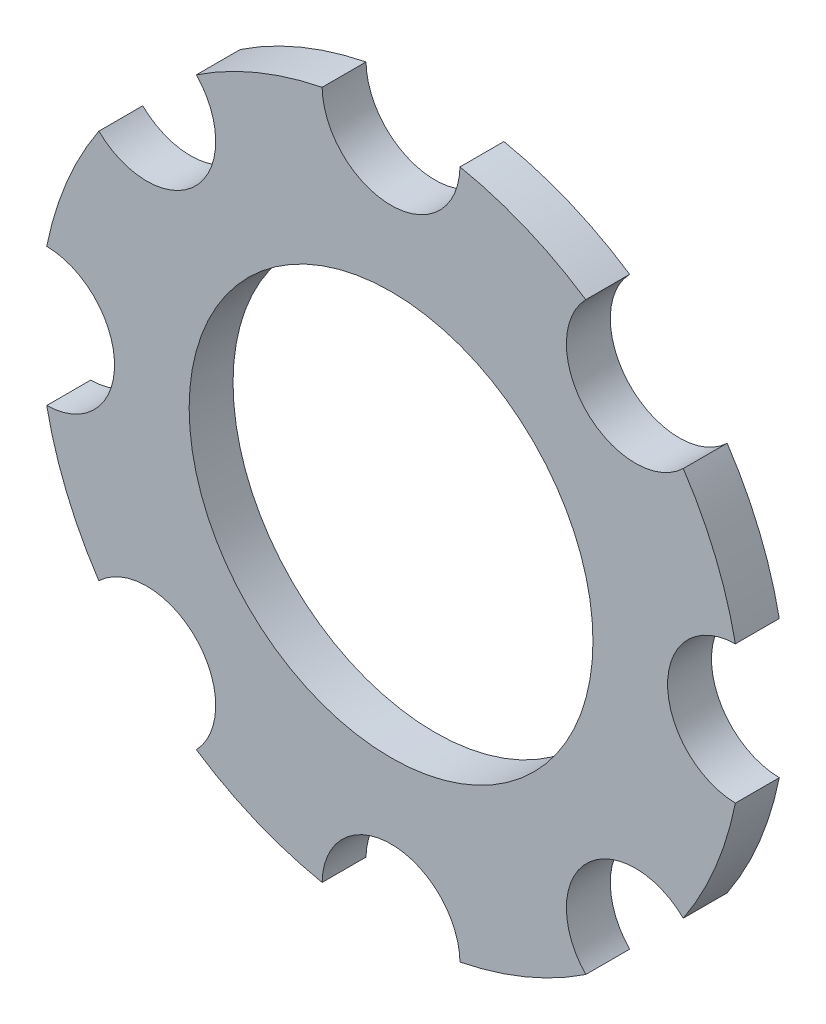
ISO-10303-21;
HEADER;
FILE_DESCRIPTION(('STEP AP214'),'2;1');
FILE_NAME('part.step','',(''),(''),'','','');
FILE_SCHEMA(('AUTOMOTIVE_DESIGN { 1 0 10303 214 1 1 1 1 }'));
ENDSEC;
DATA;
#1=APPLICATION_CONTEXT('core data for automotive mechanical design processes');
#2=APPLICATION_PROTOCOL_DEFINITION('international standard','automotive_design',2000,#1);
#3=PRODUCT_CONTEXT('',#1,'mechanical');
#4=PRODUCT('Part','Part','',(#3));
#5=PRODUCT_RELATED_PRODUCT_CATEGORY('part','',(#4));
#6=PRODUCT_DEFINITION_FORMATION('','',#4);
#7=PRODUCT_DEFINITION_CONTEXT('part definition',#1,'design');
#8=PRODUCT_DEFINITION('design','',#6,#7);
#9=PRODUCT_DEFINITION_SHAPE('','',#8);
#10=(LENGTH_UNIT() NAMED_UNIT(*) SI_UNIT(.MILLI.,.METRE.));
#11=(NAMED_UNIT(*) PLANE_ANGLE_UNIT() SI_UNIT($,.RADIAN.));
#12=(NAMED_UNIT(*) SI_UNIT($,.STERADIAN.) SOLID_ANGLE_UNIT());
#13=UNCERTAINTY_MEASURE_WITH_UNIT(LENGTH_MEASURE(1.E-05),#10,'distance_accuracy_value','');
#14=(GEOMETRIC_REPRESENTATION_CONTEXT(3) GLOBAL_UNCERTAINTY_ASSIGNED_CONTEXT((#13)) GLOBAL_UNIT_ASSIGNED_CONTEXT((#10,
#11,#12)) REPRESENTATION_CONTEXT('',''));
#15=CARTESIAN_POINT('',(0.,0.,0.));
#16=DIRECTION('',(0.,0.,1.));
#17=DIRECTION('',(1.,0.,0.));
#18=AXIS2_PLACEMENT_3D('',#15,#16,#17);
#19=CARTESIAN_POINT('',(0.,0.,-0.5));
#20=DIRECTION('',(0.,0.,1.));
#21=DIRECTION('',(1.,0.,0.));
#22=AXIS2_PLACEMENT_3D('',#19,#20,#21);
#23=CYLINDRICAL_SURFACE('',#22,4.);
#24=DIRECTION('',(0.,0.,1.));
#25=VECTOR('',#24,1.);
#26=CARTESIAN_POINT('',(2.2181037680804,3.32866574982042,-0.25));
#27=LINE('',#26,#25);
#28=CARTESIAN_POINT('',(2.2181037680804,3.32866574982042,-0.5));
#29=VERTEX_POINT('',#28);
#30=CARTESIAN_POINT('',(2.2181037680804,3.32866574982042,0.));
#31=VERTEX_POINT('',#30);
#32=EDGE_CURVE('E53',#29,#31,#27,.T.);
#33=ORIENTED_EDGE('',*,*,#32,.F.);
#34=CARTESIAN_POINT('',(0.,0.,-0.5));
#35=DIRECTION('',(0.,0.,1.));
#36=DIRECTION('',(1.,0.,0.));
#37=AXIS2_PLACEMENT_3D('',#34,#35,#36);
#38=CIRCLE('',#37,4.);
#39=CARTESIAN_POINT('',(0.785285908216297,3.92215833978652,-0.5));
#40=VERTEX_POINT('',#39);
#41=EDGE_CURVE('E176',#29,#40,#38,.T.);
#42=ORIENTED_EDGE('',*,*,#41,.T.);
#43=DIRECTION('',(0.,0.,1.));
#44=VECTOR('',#43,1.);
#45=CARTESIAN_POINT('',(0.785285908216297,3.92215833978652,-0.25));
#46=LINE('',#45,#44);
#47=CARTESIAN_POINT('',(0.785285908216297,3.92215833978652,0.));
#48=VERTEX_POINT('',#47);
#49=EDGE_CURVE('E258',#48,#40,#46,.F.);
#50=ORIENTED_EDGE('',*,*,#49,.F.);
#51=CARTESIAN_POINT('',(0.,0.,0.));
#52=DIRECTION('',(0.,0.,1.));
#53=DIRECTION('',(1.,0.,0.));
#54=AXIS2_PLACEMENT_3D('',#51,#52,#53);
#55=CIRCLE('',#54,4.);
#56=EDGE_CURVE('E168',#31,#48,#55,.T.);
#57=ORIENTED_EDGE('',*,*,#56,.F.);
#58=EDGE_LOOP('',(#33,#42,#50,#57));
#59=FACE_BOUND('',#58,.T.);
#60=ADVANCED_FACE('F39',(#59),#23,.T.);
#61=DIRECTION('',(0.,0.,1.));
#62=VECTOR('',#61,1.);
#63=CARTESIAN_POINT('',(3.32866574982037,2.21810376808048,-0.25));
#64=LINE('',#63,#62);
#65=CARTESIAN_POINT('',(3.32866574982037,2.21810376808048,0.));
#66=VERTEX_POINT('',#65);
#67=CARTESIAN_POINT('',(3.32866574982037,2.21810376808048,-0.5));
#68=VERTEX_POINT('',#67);
#69=EDGE_CURVE('E150',#66,#68,#64,.F.);
#70=ORIENTED_EDGE('',*,*,#69,.F.);
#71=CARTESIAN_POINT('',(3.92215833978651,0.785285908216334,0.));
#72=VERTEX_POINT('',#71);
#73=EDGE_CURVE('E159',#72,#66,#55,.T.);
#74=ORIENTED_EDGE('',*,*,#73,.F.);
#75=DIRECTION('',(0.,0.,1.));
#76=VECTOR('',#75,1.);
#77=CARTESIAN_POINT('',(3.92215833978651,0.785285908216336,-0.25));
#78=LINE('',#77,#76);
#79=CARTESIAN_POINT('',(3.92215833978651,0.785285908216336,-0.5));
#80=VERTEX_POINT('',#79);
#81=EDGE_CURVE('E61',#80,#72,#78,.T.);
#82=ORIENTED_EDGE('',*,*,#81,.F.);
#83=EDGE_CURVE('E161',#80,#68,#38,.T.);
#84=ORIENTED_EDGE('',*,*,#83,.T.);
#85=EDGE_LOOP('',(#70,#74,#82,#84));
#86=FACE_BOUND('',#85,.T.);
#87=ADVANCED_FACE('F158',(#86),#23,.T.);
#88=DIRECTION('',(0.,0.,1.));
#89=VECTOR('',#88,1.);
#90=CARTESIAN_POINT('',(3.92215833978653,-0.785285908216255,-0.25));
#91=LINE('',#90,#89);
#92=CARTESIAN_POINT('',(3.92215833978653,-0.785285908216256,0.));
#93=VERTEX_POINT('',#92);
#94=CARTESIAN_POINT('',(3.92215833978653,-0.785285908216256,-0.5));
#95=VERTEX_POINT('',#94);
#96=EDGE_CURVE('E194',#93,#95,#91,.F.);
#97=ORIENTED_EDGE('',*,*,#96,.F.);
#98=CARTESIAN_POINT('',(3.32866574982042,-2.21810376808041,0.));
#99=VERTEX_POINT('',#98);
#100=EDGE_CURVE('E167',#99,#93,#55,.T.);
#101=ORIENTED_EDGE('',*,*,#100,.F.);
#102=DIRECTION('',(0.,0.,1.));
#103=VECTOR('',#102,1.);
#104=CARTESIAN_POINT('',(3.32866574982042,-2.21810376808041,-0.25));
#105=LINE('',#104,#103);
#106=CARTESIAN_POINT('',(3.32866574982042,-2.21810376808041,-0.5));
#107=VERTEX_POINT('',#106);
#108=EDGE_CURVE('E214',#107,#99,#105,.T.);
#109=ORIENTED_EDGE('',*,*,#108,.F.);
#110=EDGE_CURVE('E202',#107,#95,#38,.T.);
#111=ORIENTED_EDGE('',*,*,#110,.T.);
#112=EDGE_LOOP('',(#97,#101,#109,#111));
#113=FACE_BOUND('',#112,.T.);
#114=ADVANCED_FACE('F199',(#113),#23,.T.);
#115=DIRECTION('',(0.,0.,1.));
#116=VECTOR('',#115,1.);
#117=CARTESIAN_POINT('',(2.21810376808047,-3.32866574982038,-0.25));
#118=LINE('',#117,#116);
#119=CARTESIAN_POINT('',(2.21810376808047,-3.32866574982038,0.));
#120=VERTEX_POINT('',#119);
#121=CARTESIAN_POINT('',(2.21810376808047,-3.32866574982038,-0.5));
#122=VERTEX_POINT('',#121);
#123=EDGE_CURVE('E212',#120,#122,#118,.F.);
#124=ORIENTED_EDGE('',*,*,#123,.F.);
#125=CARTESIAN_POINT('',(0.785285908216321,-3.92215833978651,0.));
#126=VERTEX_POINT('',#125);
#127=EDGE_CURVE('E170',#126,#120,#55,.T.);
#128=ORIENTED_EDGE('',*,*,#127,.F.);
#129=DIRECTION('',(0.,0.,1.));
#130=VECTOR('',#129,1.);
#131=CARTESIAN_POINT('',(0.785285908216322,-3.92215833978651,-0.25));
#132=LINE('',#131,#130);
#133=CARTESIAN_POINT('',(0.785285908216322,-3.92215833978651,-0.5));
#134=VERTEX_POINT('',#133);
#135=EDGE_CURVE('E232',#134,#126,#132,.T.);
#136=ORIENTED_EDGE('',*,*,#135,.F.);
#137=EDGE_CURVE('E220',#134,#122,#38,.T.);
#138=ORIENTED_EDGE('',*,*,#137,.T.);
#139=EDGE_LOOP('',(#124,#128,#136,#138));
#140=FACE_BOUND('',#139,.T.);
#141=ADVANCED_FACE('F217',(#140),#23,.T.);
#142=DIRECTION('',(0.,0.,1.));
#143=VECTOR('',#142,1.);
#144=CARTESIAN_POINT('',(-0.785285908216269,-3.92215833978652,-0.25));
#145=LINE('',#144,#143);
#146=CARTESIAN_POINT('',(-0.785285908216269,-3.92215833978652,0.));
#147=VERTEX_POINT('',#146);
#148=CARTESIAN_POINT('',(-0.785285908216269,-3.92215833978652,-0.5));
#149=VERTEX_POINT('',#148);
#150=EDGE_CURVE('E230',#147,#149,#145,.F.);
#151=ORIENTED_EDGE('',*,*,#150,.F.);
#152=CARTESIAN_POINT('',(-2.21810376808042,-3.32866574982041,0.));
#153=VERTEX_POINT('',#152);
#154=EDGE_CURVE('E332',#153,#147,#55,.T.);
#155=ORIENTED_EDGE('',*,*,#154,.F.);
#156=DIRECTION('',(0.,0.,1.));
#157=VECTOR('',#156,1.);
#158=CARTESIAN_POINT('',(-2.21810376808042,-3.32866574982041,-0.25));
#159=LINE('',#158,#157);
#160=CARTESIAN_POINT('',(-2.21810376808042,-3.32866574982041,-0.5));
#161=VERTEX_POINT('',#160);
#162=EDGE_CURVE('E239',#161,#153,#159,.T.);
#163=ORIENTED_EDGE('',*,*,#162,.F.);
#164=EDGE_CURVE('E316',#161,#149,#38,.T.);
#165=ORIENTED_EDGE('',*,*,#164,.T.);
#166=EDGE_LOOP('',(#151,#155,#163,#165));
#167=FACE_BOUND('',#166,.T.);
#168=ADVANCED_FACE('F326',(#167),#23,.T.);
#169=DIRECTION('',(0.,0.,1.));
#170=VECTOR('',#169,1.);
#171=CARTESIAN_POINT('',(-3.32866574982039,-2.21810376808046,-0.25));
#172=LINE('',#171,#170);
#173=CARTESIAN_POINT('',(-3.32866574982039,-2.21810376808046,0.));
#174=VERTEX_POINT('',#173);
#175=CARTESIAN_POINT('',(-3.32866574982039,-2.21810376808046,-0.5));
#176=VERTEX_POINT('',#175);
#177=EDGE_CURVE('E237',#174,#176,#172,.F.);
#178=ORIENTED_EDGE('',*,*,#177,.F.);
#179=CARTESIAN_POINT('',(-3.92215833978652,-0.785285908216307,0.));
#180=VERTEX_POINT('',#179);
#181=EDGE_CURVE('E334',#180,#174,#55,.T.);
#182=ORIENTED_EDGE('',*,*,#181,.F.);
#183=DIRECTION('',(0.,0.,1.));
#184=VECTOR('',#183,1.);
#185=CARTESIAN_POINT('',(-3.92215833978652,-0.785285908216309,-0.25));
#186=LINE('',#185,#184);
#187=CARTESIAN_POINT('',(-3.92215833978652,-0.785285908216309,-0.5));
#188=VERTEX_POINT('',#187);
#189=EDGE_CURVE('E246',#188,#180,#186,.T.);
#190=ORIENTED_EDGE('',*,*,#189,.F.);
#191=EDGE_CURVE('E311',#188,#176,#38,.T.);
#192=ORIENTED_EDGE('',*,*,#191,.T.);
#193=EDGE_LOOP('',(#178,#182,#190,#192));
#194=FACE_BOUND('',#193,.T.);
#195=ADVANCED_FACE('F293',(#194),#23,.T.);
#196=DIRECTION('',(0.,0.,1.));
#197=VECTOR('',#196,1.);
#198=CARTESIAN_POINT('',(-3.92215833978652,0.785285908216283,-0.25));
#199=LINE('',#198,#197);
#200=CARTESIAN_POINT('',(-3.92215833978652,0.785285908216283,0.));
#201=VERTEX_POINT('',#200);
#202=CARTESIAN_POINT('',(-3.92215833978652,0.785285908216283,-0.5));
#203=VERTEX_POINT('',#202);
#204=EDGE_CURVE('E244',#201,#203,#199,.F.);
#205=ORIENTED_EDGE('',*,*,#204,.F.);
#206=CARTESIAN_POINT('',(-3.3286657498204,2.21810376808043,0.));
#207=VERTEX_POINT('',#206);
#208=EDGE_CURVE('E177',#207,#201,#55,.T.);
#209=ORIENTED_EDGE('',*,*,#208,.F.);
#210=DIRECTION('',(0.,0.,1.));
#211=VECTOR('',#210,1.);
#212=CARTESIAN_POINT('',(-3.3286657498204,2.21810376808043,-0.25));
#213=LINE('',#212,#211);
#214=CARTESIAN_POINT('',(-3.3286657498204,2.21810376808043,-0.5));
#215=VERTEX_POINT('',#214);
#216=EDGE_CURVE('E253',#215,#207,#213,.T.);
#217=ORIENTED_EDGE('',*,*,#216,.F.);
#218=EDGE_CURVE('E309',#215,#203,#38,.T.);
#219=ORIENTED_EDGE('',*,*,#218,.T.);
#220=EDGE_LOOP('',(#205,#209,#217,#219));
#221=FACE_BOUND('',#220,.T.);
#222=ADVANCED_FACE('F288',(#221),#23,.T.);
#223=DIRECTION('',(0.,0.,1.));
#224=VECTOR('',#223,1.);
#225=CARTESIAN_POINT('',(-2.21810376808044,3.32866574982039,-0.25));
#226=LINE('',#225,#224);
#227=CARTESIAN_POINT('',(-2.21810376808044,3.32866574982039,0.));
#228=VERTEX_POINT('',#227);
#229=CARTESIAN_POINT('',(-2.21810376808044,3.32866574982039,-0.5));
#230=VERTEX_POINT('',#229);
#231=EDGE_CURVE('E251',#228,#230,#226,.F.);
#232=ORIENTED_EDGE('',*,*,#231,.F.);
#233=CARTESIAN_POINT('',(-0.785285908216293,3.92215833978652,0.));
#234=VERTEX_POINT('',#233);
#235=EDGE_CURVE('E172',#234,#228,#55,.T.);
#236=ORIENTED_EDGE('',*,*,#235,.F.);
#237=DIRECTION('',(0.,0.,1.));
#238=VECTOR('',#237,1.);
#239=CARTESIAN_POINT('',(-0.785285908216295,3.92215833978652,-0.25));
#240=LINE('',#239,#238);
#241=CARTESIAN_POINT('',(-0.785285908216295,3.92215833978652,-0.5));
#242=VERTEX_POINT('',#241);
#243=EDGE_CURVE('E261',#242,#234,#240,.T.);
#244=ORIENTED_EDGE('',*,*,#243,.F.);
#245=EDGE_CURVE('E178',#242,#230,#38,.T.);
#246=ORIENTED_EDGE('',*,*,#245,.T.);
#247=EDGE_LOOP('',(#232,#236,#244,#246));
#248=FACE_BOUND('',#247,.T.);
#249=ADVANCED_FACE('F41',(#248),#23,.T.);
#250=CARTESIAN_POINT('',(0.,0.,-0.5));
#251=DIRECTION('',(0.,0.,1.));
#252=DIRECTION('',(1.,0.,0.));
#253=AXIS2_PLACEMENT_3D('',#250,#251,#252);
#254=PLANE('',#253);
#255=CARTESIAN_POINT('',(0.,0.,-0.5));
#256=DIRECTION('',(0.,0.,1.));
#257=DIRECTION('',(1.,0.,0.));
#258=AXIS2_PLACEMENT_3D('',#255,#256,#257);
#259=CIRCLE('',#258,2.3);
#260=CARTESIAN_POINT('',(2.3,0.,-0.5));
#261=VERTEX_POINT('',#260);
#262=EDGE_CURVE('E171',#261,#261,#259,.T.);
#263=ORIENTED_EDGE('',*,*,#262,.T.);
#264=EDGE_LOOP('',(#263));
#265=FACE_BOUND('',#264,.T.);
#266=ORIENTED_EDGE('',*,*,#41,.F.);
#267=CARTESIAN_POINT('',(2.78274625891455,2.78274625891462,-0.5));
#268=DIRECTION('',(0.,0.,1.));
#269=DIRECTION('',(-0.707106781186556,0.707106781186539,0.));
#270=AXIS2_PLACEMENT_3D('',#267,#268,#269);
#271=CIRCLE('',#270,0.7853975);
#272=EDGE_CURVE('E162',#29,#68,#271,.T.);
#273=ORIENTED_EDGE('',*,*,#272,.T.);
#274=ORIENTED_EDGE('',*,*,#83,.F.);
#275=CARTESIAN_POINT('',(3.9353975,0.,-0.5));
#276=DIRECTION('',(0.,0.,1.));
#277=DIRECTION('',(0.,1.,0.));
#278=AXIS2_PLACEMENT_3D('',#275,#276,#277);
#279=CIRCLE('',#278,0.7853975);
#280=EDGE_CURVE('E203',#80,#95,#279,.T.);
#281=ORIENTED_EDGE('',*,*,#280,.T.);
#282=ORIENTED_EDGE('',*,*,#110,.F.);
#283=CARTESIAN_POINT('',(2.78274625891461,-2.78274625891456,-0.5));
#284=DIRECTION('',(0.,0.,1.));
#285=DIRECTION('',(0.707106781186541,0.707106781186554,0.));
#286=AXIS2_PLACEMENT_3D('',#283,#284,#285);
#287=CIRCLE('',#286,0.7853975);
#288=EDGE_CURVE('E221',#107,#122,#287,.T.);
#289=ORIENTED_EDGE('',*,*,#288,.T.);
#290=ORIENTED_EDGE('',*,*,#137,.F.);
#291=CARTESIAN_POINT('',(0.,-3.9353975,-0.5));
#292=DIRECTION('',(0.,0.,1.));
#293=DIRECTION('',(1.,0.,0.));
#294=AXIS2_PLACEMENT_3D('',#291,#292,#293);
#295=CIRCLE('',#294,0.7853975);
#296=EDGE_CURVE('E223',#134,#149,#295,.T.);
#297=ORIENTED_EDGE('',*,*,#296,.T.);
#298=ORIENTED_EDGE('',*,*,#164,.F.);
#299=CARTESIAN_POINT('',(-2.78274625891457,-2.7827462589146,-0.5));
#300=DIRECTION('',(0.,0.,1.));
#301=DIRECTION('',(0.707106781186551,-0.707106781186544,0.));
#302=AXIS2_PLACEMENT_3D('',#299,#300,#301);
#303=CIRCLE('',#302,0.7853975);
#304=EDGE_CURVE('E234',#161,#176,#303,.T.);
#305=ORIENTED_EDGE('',*,*,#304,.T.);
#306=ORIENTED_EDGE('',*,*,#191,.F.);
#307=CARTESIAN_POINT('',(-3.9353975,0.,-0.5));
#308=DIRECTION('',(0.,0.,1.));
#309=DIRECTION('',(0.,-1.,0.));
#310=AXIS2_PLACEMENT_3D('',#307,#308,#309);
#311=CIRCLE('',#310,0.7853975);
#312=EDGE_CURVE('E241',#188,#203,#311,.T.);
#313=ORIENTED_EDGE('',*,*,#312,.T.);
#314=ORIENTED_EDGE('',*,*,#218,.F.);
#315=CARTESIAN_POINT('',(-2.78274625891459,2.78274625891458,-0.5));
#316=DIRECTION('',(0.,0.,1.));
#317=DIRECTION('',(-0.707106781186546,-0.707106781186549,0.));
#318=AXIS2_PLACEMENT_3D('',#315,#316,#317);
#319=CIRCLE('',#318,0.7853975);
#320=EDGE_CURVE('E248',#215,#230,#319,.T.);
#321=ORIENTED_EDGE('',*,*,#320,.T.);
#322=ORIENTED_EDGE('',*,*,#245,.F.);
#323=CARTESIAN_POINT('',(0.,3.9353975,-0.5));
#324=DIRECTION('',(0.,0.,1.));
#325=DIRECTION('',(-1.,0.,0.));
#326=AXIS2_PLACEMENT_3D('',#323,#324,#325);
#327=CIRCLE('',#326,0.7853975);
#328=EDGE_CURVE('E255',#242,#40,#327,.T.);
#329=ORIENTED_EDGE('',*,*,#328,.T.);
#330=EDGE_LOOP('',(#266,#273,#274,#281,#282,#289,#290,#297,#298,#305,#306,#313,#314,#321,#322,#329));
#331=FACE_BOUND('',#330,.T.);
#332=ADVANCED_FACE('F270',(#265,#331),#254,.F.);
#333=CARTESIAN_POINT('',(0.,0.,0.));
#334=DIRECTION('',(0.,0.,1.));
#335=DIRECTION('',(1.,0.,0.));
#336=AXIS2_PLACEMENT_3D('',#333,#334,#335);
#337=PLANE('',#336);
#338=CARTESIAN_POINT('',(2.78274625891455,2.78274625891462,0.));
#339=DIRECTION('',(0.,0.,1.));
#340=DIRECTION('',(1.,0.,0.));
#341=AXIS2_PLACEMENT_3D('',#338,#339,#340);
#342=CIRCLE('',#341,0.7853975);
#343=EDGE_CURVE('E11',#31,#66,#342,.T.);
#344=ORIENTED_EDGE('',*,*,#343,.F.);
#345=ORIENTED_EDGE('',*,*,#56,.T.);
#346=CARTESIAN_POINT('',(0.,3.9353975,0.));
#347=DIRECTION('',(0.,0.,1.));
#348=DIRECTION('',(1.,0.,0.));
#349=AXIS2_PLACEMENT_3D('',#346,#347,#348);
#350=CIRCLE('',#349,0.7853975);
#351=EDGE_CURVE('E180',#234,#48,#350,.T.);
#352=ORIENTED_EDGE('',*,*,#351,.F.);
#353=ORIENTED_EDGE('',*,*,#235,.T.);
#354=CARTESIAN_POINT('',(-2.78274625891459,2.78274625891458,0.));
#355=DIRECTION('',(0.,0.,1.));
#356=DIRECTION('',(1.,0.,0.));
#357=AXIS2_PLACEMENT_3D('',#354,#355,#356);
#358=CIRCLE('',#357,0.7853975);
#359=EDGE_CURVE('E183',#207,#228,#358,.T.);
#360=ORIENTED_EDGE('',*,*,#359,.F.);
#361=ORIENTED_EDGE('',*,*,#208,.T.);
#362=CARTESIAN_POINT('',(-3.9353975,0.,0.));
#363=DIRECTION('',(0.,0.,1.));
#364=DIRECTION('',(1.,0.,0.));
#365=AXIS2_PLACEMENT_3D('',#362,#363,#364);
#366=CIRCLE('',#365,0.7853975);
#367=EDGE_CURVE('E185',#180,#201,#366,.T.);
#368=ORIENTED_EDGE('',*,*,#367,.F.);
#369=ORIENTED_EDGE('',*,*,#181,.T.);
#370=CARTESIAN_POINT('',(-2.78274625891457,-2.7827462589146,0.));
#371=DIRECTION('',(0.,0.,1.));
#372=DIRECTION('',(1.,0.,0.));
#373=AXIS2_PLACEMENT_3D('',#370,#371,#372);
#374=CIRCLE('',#373,0.7853975);
#375=EDGE_CURVE('E187',#153,#174,#374,.T.);
#376=ORIENTED_EDGE('',*,*,#375,.F.);
#377=ORIENTED_EDGE('',*,*,#154,.T.);
#378=CARTESIAN_POINT('',(0.,-3.9353975,0.));
#379=DIRECTION('',(0.,0.,1.));
#380=DIRECTION('',(1.,0.,0.));
#381=AXIS2_PLACEMENT_3D('',#378,#379,#380);
#382=CIRCLE('',#381,0.7853975);
#383=EDGE_CURVE('E189',#126,#147,#382,.T.);
#384=ORIENTED_EDGE('',*,*,#383,.F.);
#385=ORIENTED_EDGE('',*,*,#127,.T.);
#386=CARTESIAN_POINT('',(2.78274625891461,-2.78274625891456,0.));
#387=DIRECTION('',(0.,0.,1.));
#388=DIRECTION('',(1.,0.,0.));
#389=AXIS2_PLACEMENT_3D('',#386,#387,#388);
#390=CIRCLE('',#389,0.7853975);
#391=EDGE_CURVE('E191',#99,#120,#390,.T.);
#392=ORIENTED_EDGE('',*,*,#391,.F.);
#393=ORIENTED_EDGE('',*,*,#100,.T.);
#394=CARTESIAN_POINT('',(3.9353975,0.,0.));
#395=DIRECTION('',(0.,0.,1.));
#396=DIRECTION('',(1.,0.,0.));
#397=AXIS2_PLACEMENT_3D('',#394,#395,#396);
#398=CIRCLE('',#397,0.7853975);
#399=EDGE_CURVE('E47',#72,#93,#398,.T.);
#400=ORIENTED_EDGE('',*,*,#399,.F.);
#401=ORIENTED_EDGE('',*,*,#73,.T.);
#402=EDGE_LOOP('',(#344,#345,#352,#353,#360,#361,#368,#369,#376,#377,#384,#385,#392,#393,#400,#401));
#403=FACE_BOUND('',#402,.T.);
#404=CARTESIAN_POINT('',(0.,0.,0.));
#405=DIRECTION('',(0.,0.,1.));
#406=DIRECTION('',(1.,0.,0.));
#407=AXIS2_PLACEMENT_3D('',#404,#405,#406);
#408=CIRCLE('',#407,2.3);
#409=CARTESIAN_POINT('',(2.3,0.,0.));
#410=VERTEX_POINT('',#409);
#411=EDGE_CURVE('E263',#410,#410,#408,.T.);
#412=ORIENTED_EDGE('',*,*,#411,.F.);
#413=EDGE_LOOP('',(#412));
#414=FACE_BOUND('',#413,.T.);
#415=ADVANCED_FACE('F164',(#403,#414),#337,.T.);
#416=CARTESIAN_POINT('',(0.,0.,-0.5));
#417=DIRECTION('',(0.,0.,1.));
#418=DIRECTION('',(1.,0.,0.));
#419=AXIS2_PLACEMENT_3D('',#416,#417,#418);
#420=CYLINDRICAL_SURFACE('',#419,2.3);
#421=ORIENTED_EDGE('',*,*,#262,.F.);
#422=EDGE_LOOP('',(#421));
#423=FACE_BOUND('',#422,.T.);
#424=ORIENTED_EDGE('',*,*,#411,.T.);
#425=EDGE_LOOP('',(#424));
#426=FACE_BOUND('',#425,.T.);
#427=ADVANCED_FACE('F268',(#423,#426),#420,.F.);
#428=CARTESIAN_POINT('',(0.,3.9353975,-0.5));
#429=DIRECTION('',(0.,0.,1.));
#430=DIRECTION('',(1.,0.,0.));
#431=AXIS2_PLACEMENT_3D('',#428,#429,#430);
#432=CYLINDRICAL_SURFACE('',#431,0.7853975);
#433=ORIENTED_EDGE('',*,*,#243,.T.);
#434=ORIENTED_EDGE('',*,*,#351,.T.);
#435=ORIENTED_EDGE('',*,*,#49,.T.);
#436=ORIENTED_EDGE('',*,*,#328,.F.);
#437=EDGE_LOOP('',(#433,#434,#435,#436));
#438=FACE_BOUND('',#437,.T.);
#439=ADVANCED_FACE('F276',(#438),#432,.F.);
#440=CARTESIAN_POINT('',(-2.78274625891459,2.78274625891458,-0.5));
#441=DIRECTION('',(0.,0.,1.));
#442=DIRECTION('',(1.,0.,0.));
#443=AXIS2_PLACEMENT_3D('',#440,#441,#442);
#444=CYLINDRICAL_SURFACE('',#443,0.7853975);
#445=ORIENTED_EDGE('',*,*,#216,.T.);
#446=ORIENTED_EDGE('',*,*,#359,.T.);
#447=ORIENTED_EDGE('',*,*,#231,.T.);
#448=ORIENTED_EDGE('',*,*,#320,.F.);
#449=EDGE_LOOP('',(#445,#446,#447,#448));
#450=FACE_BOUND('',#449,.T.);
#451=ADVANCED_FACE('F339',(#450),#444,.F.);
#452=CARTESIAN_POINT('',(-3.9353975,0.,-0.5));
#453=DIRECTION('',(0.,0.,1.));
#454=DIRECTION('',(1.,0.,0.));
#455=AXIS2_PLACEMENT_3D('',#452,#453,#454);
#456=CYLINDRICAL_SURFACE('',#455,0.7853975);
#457=ORIENTED_EDGE('',*,*,#189,.T.);
#458=ORIENTED_EDGE('',*,*,#367,.T.);
#459=ORIENTED_EDGE('',*,*,#204,.T.);
#460=ORIENTED_EDGE('',*,*,#312,.F.);
#461=EDGE_LOOP('',(#457,#458,#459,#460));
#462=FACE_BOUND('',#461,.T.);
#463=ADVANCED_FACE('F338',(#462),#456,.F.);
#464=CARTESIAN_POINT('',(-2.78274625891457,-2.7827462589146,-0.5));
#465=DIRECTION('',(0.,0.,1.));
#466=DIRECTION('',(1.,0.,0.));
#467=AXIS2_PLACEMENT_3D('',#464,#465,#466);
#468=CYLINDRICAL_SURFACE('',#467,0.7853975);
#469=ORIENTED_EDGE('',*,*,#162,.T.);
#470=ORIENTED_EDGE('',*,*,#375,.T.);
#471=ORIENTED_EDGE('',*,*,#177,.T.);
#472=ORIENTED_EDGE('',*,*,#304,.F.);
#473=EDGE_LOOP('',(#469,#470,#471,#472));
#474=FACE_BOUND('',#473,.T.);
#475=ADVANCED_FACE('F344',(#474),#468,.F.);
#476=CARTESIAN_POINT('',(0.,-3.9353975,-0.5));
#477=DIRECTION('',(0.,0.,1.));
#478=DIRECTION('',(1.,0.,0.));
#479=AXIS2_PLACEMENT_3D('',#476,#477,#478);
#480=CYLINDRICAL_SURFACE('',#479,0.7853975);
#481=ORIENTED_EDGE('',*,*,#135,.T.);
#482=ORIENTED_EDGE('',*,*,#383,.T.);
#483=ORIENTED_EDGE('',*,*,#150,.T.);
#484=ORIENTED_EDGE('',*,*,#296,.F.);
#485=EDGE_LOOP('',(#481,#482,#483,#484));
#486=FACE_BOUND('',#485,.T.);
#487=ADVANCED_FACE('F330',(#486),#480,.F.);
#488=CARTESIAN_POINT('',(2.78274625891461,-2.78274625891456,-0.5));
#489=DIRECTION('',(0.,0.,1.));
#490=DIRECTION('',(1.,0.,0.));
#491=AXIS2_PLACEMENT_3D('',#488,#489,#490);
#492=CYLINDRICAL_SURFACE('',#491,0.7853975);
#493=ORIENTED_EDGE('',*,*,#108,.T.);
#494=ORIENTED_EDGE('',*,*,#391,.T.);
#495=ORIENTED_EDGE('',*,*,#123,.T.);
#496=ORIENTED_EDGE('',*,*,#288,.F.);
#497=EDGE_LOOP('',(#493,#494,#495,#496));
#498=FACE_BOUND('',#497,.T.);
#499=ADVANCED_FACE('F211',(#498),#492,.F.);
#500=CARTESIAN_POINT('',(3.9353975,0.,-0.5));
#501=DIRECTION('',(0.,0.,1.));
#502=DIRECTION('',(1.,0.,0.));
#503=AXIS2_PLACEMENT_3D('',#500,#501,#502);
#504=CYLINDRICAL_SURFACE('',#503,0.7853975);
#505=ORIENTED_EDGE('',*,*,#81,.T.);
#506=ORIENTED_EDGE('',*,*,#399,.T.);
#507=ORIENTED_EDGE('',*,*,#96,.T.);
#508=ORIENTED_EDGE('',*,*,#280,.F.);
#509=EDGE_LOOP('',(#505,#506,#507,#508));
#510=FACE_BOUND('',#509,.T.);
#511=ADVANCED_FACE('F193',(#510),#504,.F.);
#512=CARTESIAN_POINT('',(2.78274625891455,2.78274625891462,-0.5));
#513=DIRECTION('',(0.,0.,1.));
#514=DIRECTION('',(1.,0.,0.));
#515=AXIS2_PLACEMENT_3D('',#512,#513,#514);
#516=CYLINDRICAL_SURFACE('',#515,0.7853975);
#517=ORIENTED_EDGE('',*,*,#32,.T.);
#518=ORIENTED_EDGE('',*,*,#343,.T.);
#519=ORIENTED_EDGE('',*,*,#69,.T.);
#520=ORIENTED_EDGE('',*,*,#272,.F.);
#521=EDGE_LOOP('',(#517,#518,#519,#520));
#522=FACE_BOUND('',#521,.T.);
#523=ADVANCED_FACE('F149',(#522),#516,.F.);
#524=CLOSED_SHELL('',(#60,#87,#114,#141,#168,#195,#222,#249,#332,#415,#427,#439,#451,#463,#475,
#487,#499,#511,#523));
#525=MANIFOLD_SOLID_BREP('B2',#524);
#526=ADVANCED_BREP_SHAPE_REPRESENTATION('',(#18,#525),#14);
#527=SHAPE_DEFINITION_REPRESENTATION(#9,#526);
ENDSEC;
END-ISO-10303-21;
